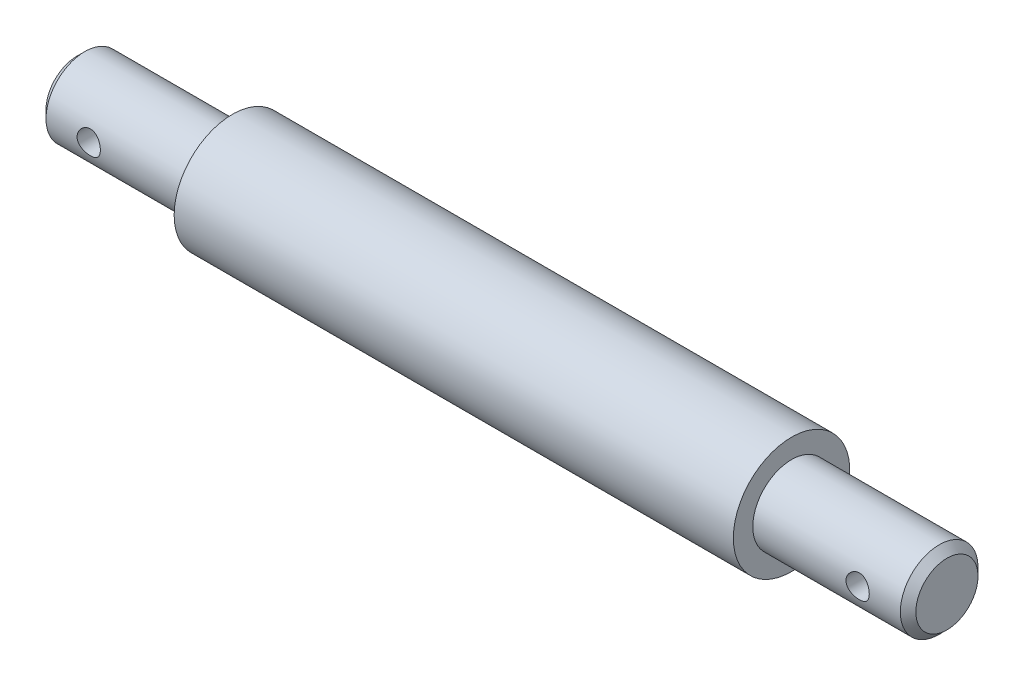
from build123d import *

# Parameters (mm, degrees)
ESQUISSE2_R             = 1.5
ENL_V_MAT_EXTRU_1_DEPTH = 20


with BuildPart() as part:
    # Esquisse1 → R_volution1 (revolve)
    with BuildSketch(Plane.XY, mode=Mode.PRIVATE) as r_volution1_sk:
        Polygon((-51.716894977, 0), (-51.716894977, 4), (-50.716894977, 5), (-31.716894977, 5), (-31.716894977, 7.5), (40.283105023, 7.5), (40.283105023, 5), (59.283105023, 5), (60.283105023, 4), (60.283105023, 0), align=None)
    revolve(r_volution1_sk.sketch.rotate(Axis((-59.925925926, 0, 0), (1, 0, 0)), 90), axis=Axis((-59.925925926, 0, 0), (1, 0, 0)))

    # Esquisse2 → Enl_v. mat.-Extru.1 (cut, symmetric)
    with BuildSketch(Plane.XY):
        with Locations((-45.216894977, 0)):
            Circle(ESQUISSE2_R)
        with Locations((53.783105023, 0)):
            Circle(ESQUISSE2_R)
    extrude(amount=ENL_V_MAT_EXTRU_1_DEPTH, both=True, mode=Mode.SUBTRACT)


solid = part.part
